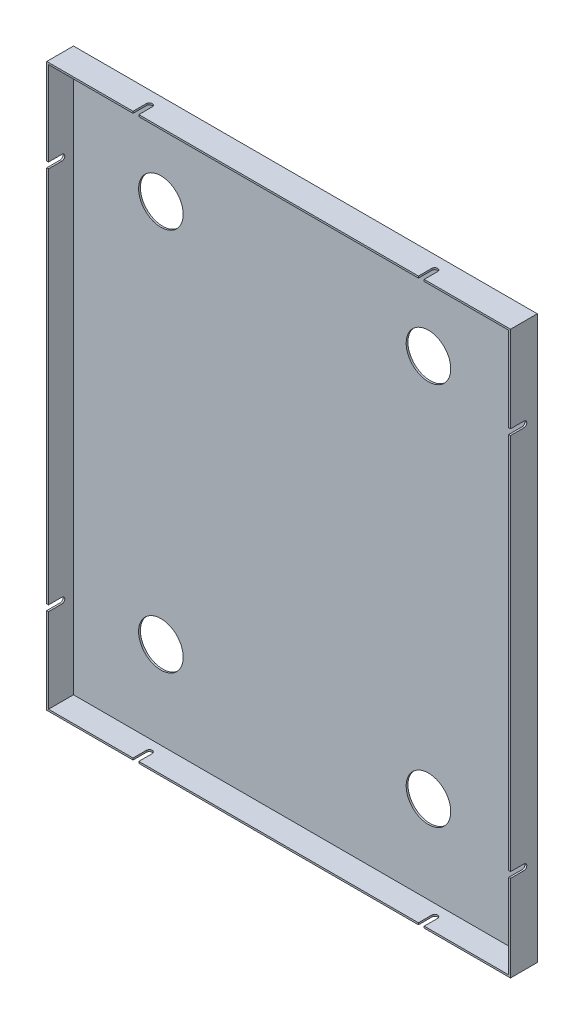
from build123d import *

# Parameters (mm, degrees)
SKETCH_1_W          = 520
SKETCH_1_H          = 630
EXTRUDE_1_DEPTH     = 30
SHELL_1_T           = -2
CUT_EXTRUDE_2_REACH = 819.435
SKETCH_3_R          = 25
CUT_EXTRUDE_4_DEPTH = 818.435012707
CUT_EXTRUDE_5_DEPTH = 818.435012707


with BuildPart() as part:
    # Sketch 1 → Extrude 1 (new body)
    with BuildSketch(Plane.XY):
        with Locations((260, -315)):
            Rectangle(SKETCH_1_W, SKETCH_1_H)
    extrude(amount=EXTRUDE_1_DEPTH)

    # Shell 1
    shell_1_openings = [part.faces().sort_by_distance(p)[0] for p in [
        (260, -315, 30),
    ]]
    offset(amount=SHELL_1_T, openings=shell_1_openings, kind=Kind.INTERSECTION)

    # Sketch 3 → Cut-Extrude 2 (cut, up to next)
    with BuildSketch(Plane(origin=(0, 0, 0), x_dir=(-1, 0, 0), z_dir=(0, 0, -1)), mode=Mode.PRIVATE) as cut_extrude_2_sk1:
        with Locations((-100, -100)):
            Circle(SKETCH_3_R)
    cut_extrude_2_tool1 = extrude(cut_extrude_2_sk1.sketch, amount=-CUT_EXTRUDE_2_REACH, mode=Mode.PRIVATE) & part.part
    # Sketch 3 → Cut-Extrude 2 (cut, up to next)
    with BuildSketch(Plane(origin=(0, 0, 0), x_dir=(-1, 0, 0), z_dir=(0, 0, -1)), mode=Mode.PRIVATE) as cut_extrude_2_sk2:
        with Locations((-400, -100)):
            Circle(SKETCH_3_R)
    cut_extrude_2_tool2 = extrude(cut_extrude_2_sk2.sketch, amount=-CUT_EXTRUDE_2_REACH, mode=Mode.PRIVATE) & part.part
    # Sketch 3 → Cut-Extrude 2 (cut, up to next)
    with BuildSketch(Plane(origin=(0, 0, 0), x_dir=(-1, 0, 0), z_dir=(0, 0, -1)), mode=Mode.PRIVATE) as cut_extrude_2_sk3:
        with Locations((-100, -530)):
            Circle(SKETCH_3_R)
    cut_extrude_2_tool3 = extrude(cut_extrude_2_sk3.sketch, amount=-CUT_EXTRUDE_2_REACH, mode=Mode.PRIVATE) & part.part
    # Sketch 3 → Cut-Extrude 2 (cut, up to next)
    with BuildSketch(Plane(origin=(0, 0, 0), x_dir=(-1, 0, 0), z_dir=(0, 0, -1)), mode=Mode.PRIVATE) as cut_extrude_2_sk4:
        with Locations((-400, -530)):
            Circle(SKETCH_3_R)
    cut_extrude_2_tool4 = extrude(cut_extrude_2_sk4.sketch, amount=-CUT_EXTRUDE_2_REACH, mode=Mode.PRIVATE) & part.part
    add(cut_extrude_2_tool1.solids().sort_by_distance((100, -100, 0))[0], mode=Mode.SUBTRACT)
    add(cut_extrude_2_tool2.solids().sort_by_distance((400, -100, 0))[0], mode=Mode.SUBTRACT)
    add(cut_extrude_2_tool3.solids().sort_by_distance((100, -530, 0))[0], mode=Mode.SUBTRACT)
    add(cut_extrude_2_tool4.solids().sort_by_distance((400, -530, 0))[0], mode=Mode.SUBTRACT)

    # Sketch 4 → Cut-Extrude 4 (cut, through all)
    with BuildSketch(Plane(origin=(520, 0, 0), x_dir=(0, 0, -1), z_dir=(1, 0, 0))):
        with BuildLine():
            Line((-30, -526.75), (-15, -526.75))
            ThreePointArc((-15, -526.75), (-11.75, -530), (-15, -533.25))
            Line((-15, -533.25), (-30, -533.25))
            ThreePointArc((-30, -533.25), (-33.25, -530), (-30, -526.75))
        make_face()
        with BuildLine():
            Line((-15, -103.25), (-30, -103.25))
            ThreePointArc((-30, -103.25), (-33.25, -100), (-30, -96.75))
            Line((-30, -96.75), (-15, -96.75))
            ThreePointArc((-15, -96.75), (-11.75, -100), (-15, -103.25))
        make_face()
    extrude(amount=-CUT_EXTRUDE_4_DEPTH, mode=Mode.SUBTRACT)

    # Sketch 5 → Cut-Extrude 5 (cut, through all)
    with BuildSketch(Plane(origin=(0, 0, 0), x_dir=(1, 0, 0), z_dir=(0, 1, 0))):
        with BuildLine():
            Line((96.75, -30), (96.75, -15))
            ThreePointArc((96.75, -15), (100, -11.75), (103.25, -15))
            Line((103.25, -15), (103.25, -30))
            ThreePointArc((103.25, -30), (100, -33.25), (96.75, -30))
        make_face()
        with BuildLine():
            Line((416.75, -30), (416.75, -15))
            ThreePointArc((416.75, -15), (420, -11.75), (423.25, -15))
            Line((423.25, -15), (423.25, -30))
            ThreePointArc((423.25, -30), (420, -33.25), (416.75, -30))
        make_face()
    extrude(amount=-CUT_EXTRUDE_5_DEPTH, mode=Mode.SUBTRACT)


solid = part.part
